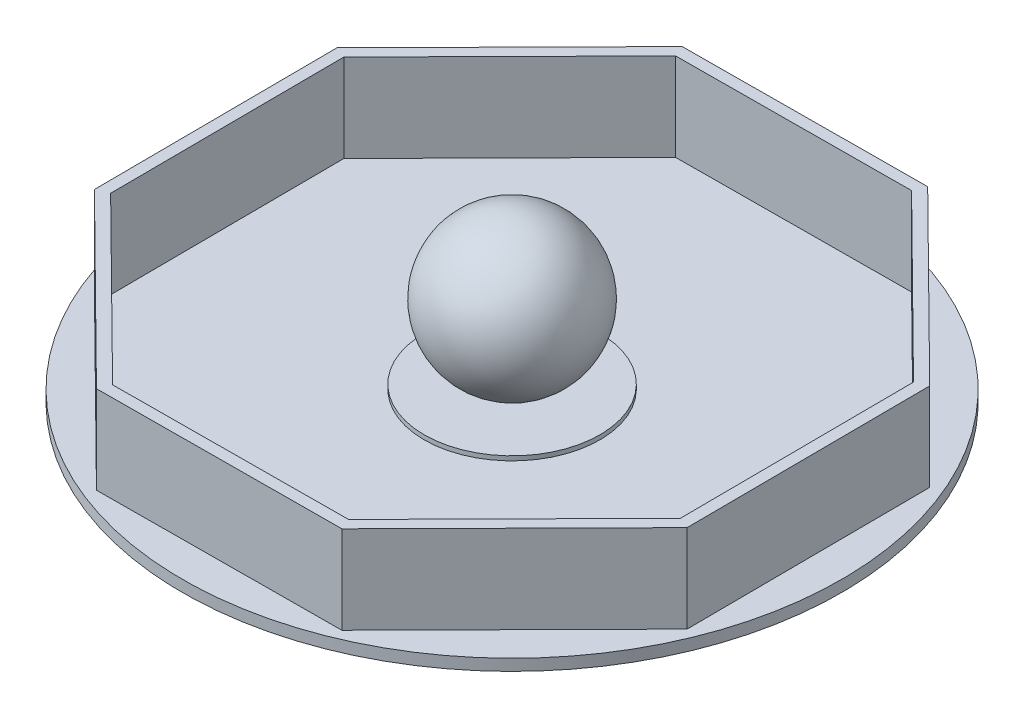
from build123d import *

# Parameters (mm, degrees)
SKETCH1_R           = 95.25
SKETCH1_R_2         = 3.175
BOSS_EXTRUDE1_DEPTH = 3.302
BOSS_EXTRUDE2_DEPTH = 25.4
SKETCH3_R           = 25.4
SKETCH3_R_2         = 3.175
BOSS_EXTRUDE3_DEPTH = 1.27


with BuildPart() as part:
    # Sketch1 → Boss-Extrude1 (new body)
    with BuildSketch(Plane(origin=(0, 0, 0), x_dir=(1, 0, 0), z_dir=(0, 1, 0))):
        with Locations(Location((0, 0, 0), (0, 0, 90))):
            Circle(SKETCH1_R)
        with Locations(Location((0, 0, 0), (0, 0, 90))):
            Circle(SKETCH1_R_2, mode=Mode.SUBTRACT)
    extrude(amount=BOSS_EXTRUDE1_DEPTH)

    # Sketch2 → Boss-Extrude2 (add)
    with BuildSketch(Plane(origin=(0, 3.302, 0), x_dir=(1, 0, 0), z_dir=(0, 1, 0))):
        Polygon((85.349254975, -34.766392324), (84.934588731, 35.767485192), (34.766392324, 85.349254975), (-35.767485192, 84.934588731), (-85.349254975, 34.766392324), (-84.934588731, -35.767485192), (-34.766392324, -85.349254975), (35.767485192, -84.934588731), align=None)
        Polygon((33.418094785, 82.039271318), (-34.380363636, 81.64068651), (-82.039271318, 33.418094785), (-81.64068651, -34.380363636), (-33.418094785, -82.039271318), (34.380363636, -81.64068651), (82.039271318, -33.418094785), (81.64068651, 34.380363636), align=None, mode=Mode.SUBTRACT)
    extrude(amount=BOSS_EXTRUDE2_DEPTH)

    # Sketch3 → Boss-Extrude3 (add)
    with BuildSketch(Plane(origin=(0, 3.302, 0), x_dir=(1, 0, 0), z_dir=(0, 1, 0))):
        with Locations(Location((0, 0, 0), (0, 0, 270))):
            Circle(SKETCH3_R)
        with Locations(Location((0, 0, 0), (0, 0, 90))):
            Circle(SKETCH3_R_2, mode=Mode.SUBTRACT)
    extrude(amount=BOSS_EXTRUDE3_DEPTH)


with BuildPart() as body_2:
    # Sketch4 → Revolve2 (revolve)
    with BuildSketch(Plane(origin=(0, 25.908, 0), x_dir=(1, 0, 0), z_dir=(0, 1, 0))):
        with BuildLine():
            Line((-21.336, 0), (21.336, 0))
            ThreePointArc((21.336, 0), (0, 21.336), (-21.336, 0))
        make_face()
    revolve(axis=Axis((-21.336, 25.908, 0), (1, 0, 0)))


solid = Compound([part.part, body_2.part])
